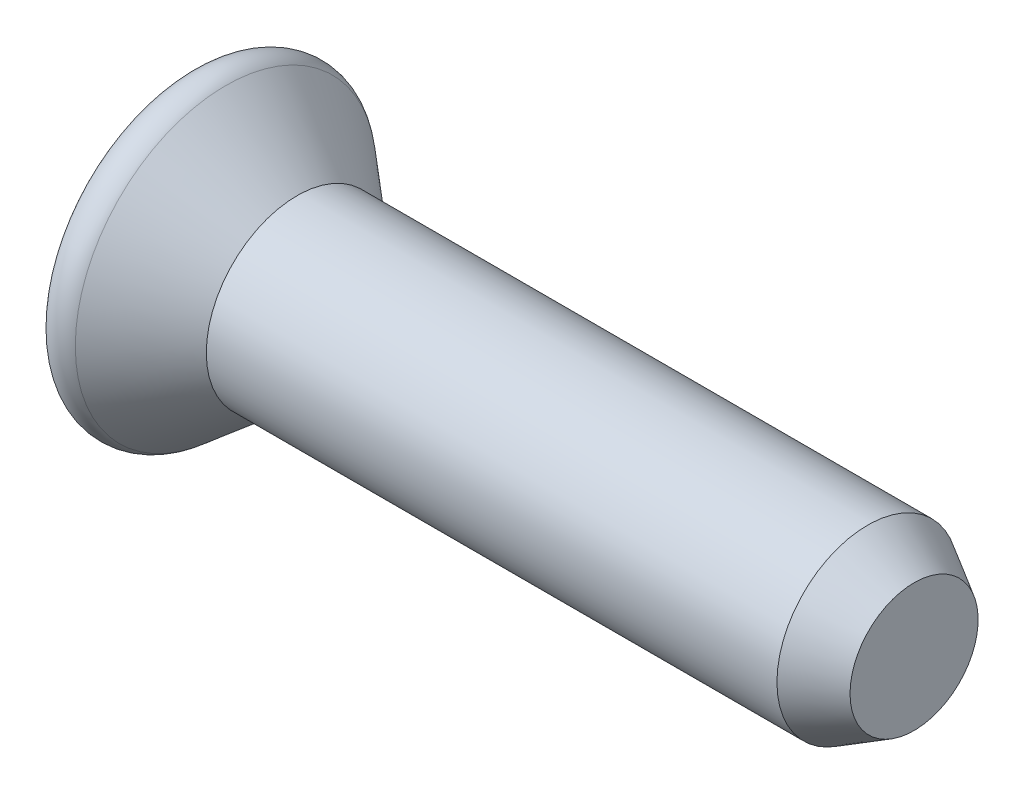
from build123d import *

# Parameters (mm, degrees)
CUT_EXTRUDE3_DEPTH         = 1.4478
DRAFT1_ANGLE               = -20
RECESSI_CUT_EXTRUDE5_DEPTH = 1.4478


with BuildPart() as part:
    # Sketch1 → base-Revolve (revolve)
    with BuildSketch(Plane.XY, mode=Mode.PRIVATE) as base_revolve_sk:
        with BuildLine():
            Line((0.33207054, 2.358608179), (1.4478, 1.4224))
            Line((1.4478, 1.4224), (11.1125, 1.4224))
            Line((11.1125, 1.4224), (11.1125, 0))
            Line((11.1125, 0), (0, 0))
            Line((0, 0), (-0.7366, 0))
            ThreePointArc((-0.7366, 0), (-0.604667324, 1.151304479), (-0.215709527, 2.242917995))
            ThreePointArc((-0.215709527, 2.242917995), (0.030014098, 2.434127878), (0.33207054, 2.358608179))
        make_face()
    revolve(base_revolve_sk.sketch.rotate(Axis((0, 0, 0), (1, 0, 0)), 90), axis=Axis((0, 0, 0), (1, 0, 0)))

    # Sketch4 → Cut-Extrude3 (cut)
    with BuildSketch(Plane(origin=(-0.7366, 0, 0), x_dir=(0, 0, -1), z_dir=(1, 0, 0))):
        Polygon((0.2413, 1.4986), (-0.2413, 1.4986), (-0.2413, 0.2413), (-1.4986, 0.2413), (-1.4986, -0.2413), (-0.2413, -0.2413), (-0.2413, -1.4986), (0.2413, -1.4986), (0.2413, -0.2413), (1.4986, -0.2413), (1.4986, 0.2413), (0.2413, 0.2413), align=None)
    extrude(amount=CUT_EXTRUDE3_DEPTH, mode=Mode.SUBTRACT)

    # Draft1
    draft1_faces = [part.faces().sort_by_distance(p)[0] for p in [
        (0.101115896, 0, -1.4986),
        (0.101115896, -1.4986, 0),
        (0.101115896, 0, 1.4986),
        (0.101115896, 1.4986, 0),
    ]]
    draft(draft1_faces, Plane(origin=(-0.7366, 0, 0), x_dir=(0, 0, 1), z_dir=(1, 0, 0)), DRAFT1_ANGLE)

    # Sketch5 → recessI_Cut-Extrude5 (cut)
    with BuildSketch(Plane.ZY.offset(0.7366)):
        Polygon((0.2413, 0.54102), (0.54102, 0.2413), (0.2413, 0.2413), align=None)
        Polygon((-0.2413, 0.2413), (-0.54102, 0.2413), (-0.2413, 0.54102), align=None)
        Polygon((-0.2413, -0.54102), (-0.54102, -0.2413), (-0.2413, -0.2413), align=None)
        Polygon((0.2413, -0.2413), (0.54102, -0.2413), (0.2413, -0.54102), align=None)
    extrude(amount=-RECESSI_CUT_EXTRUDE5_DEPTH, mode=Mode.SUBTRACT)

    # Sketch8 → point_Cut-Revolve1 (revolve, cut)
    with BuildSketch(Plane.XY, mode=Mode.PRIVATE) as point_cut_revolve1_sk:
        Polygon((11.1125, 0), (11.6205, 0), (11.6205, 1.9304), (10.386597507, 1.9304), (10.386597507, 1.4224), (11.1125, 1.0033), align=None)
    revolve(point_cut_revolve1_sk.sketch.rotate(Axis((0, 0, 0), (1, 0, 0)), 90), axis=Axis((0, 0, 0), (1, 0, 0)), mode=Mode.SUBTRACT)


solid = part.part
